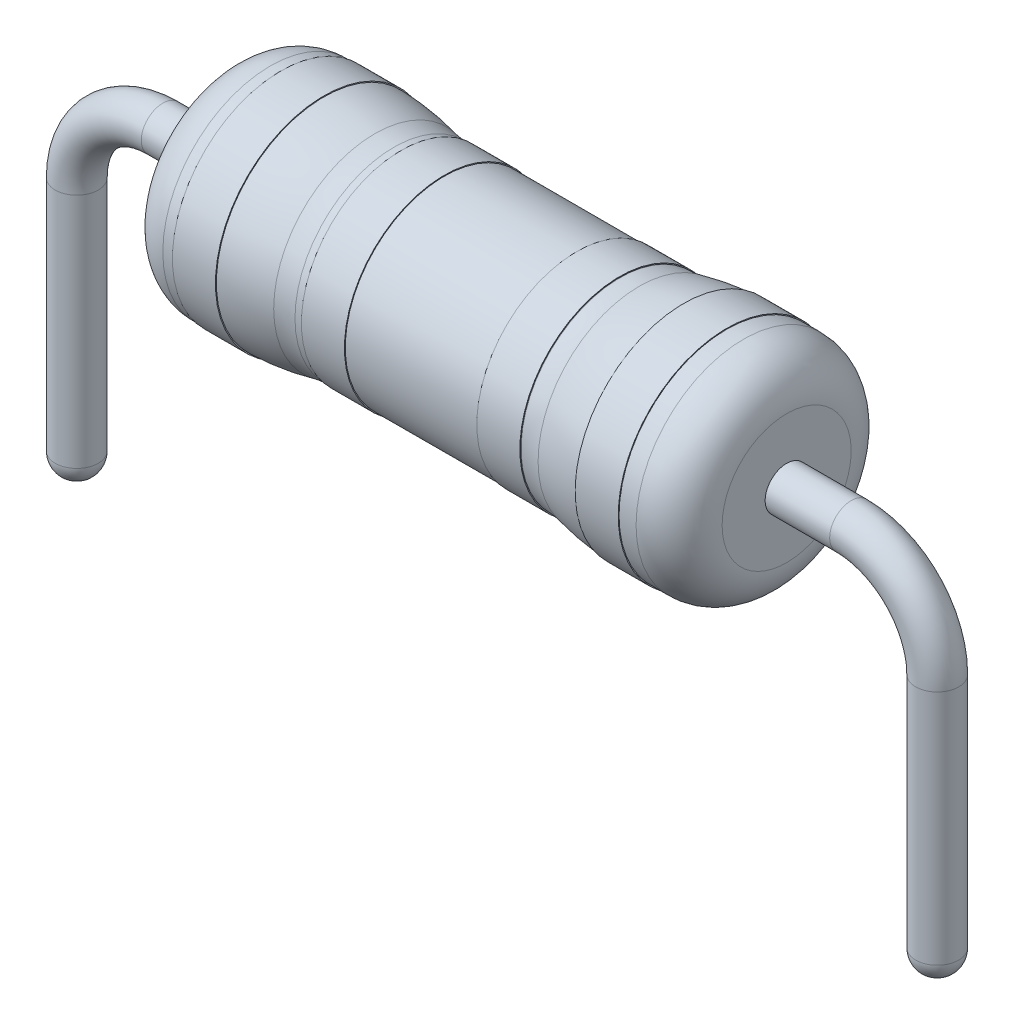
ISO-10303-21;
HEADER;
FILE_DESCRIPTION(('STEP AP214'),'2;1');
FILE_NAME('part.step','',(''),(''),'','','');
FILE_SCHEMA(('AUTOMOTIVE_DESIGN { 1 0 10303 214 1 1 1 1 }'));
ENDSEC;
DATA;
#1=APPLICATION_CONTEXT('core data for automotive mechanical design processes');
#2=APPLICATION_PROTOCOL_DEFINITION('international standard','automotive_design',2000,#1);
#3=PRODUCT_CONTEXT('',#1,'mechanical');
#4=PRODUCT('Part','Part','',(#3));
#5=PRODUCT_RELATED_PRODUCT_CATEGORY('part','',(#4));
#6=PRODUCT_DEFINITION_FORMATION('','',#4);
#7=PRODUCT_DEFINITION_CONTEXT('part definition',#1,'design');
#8=PRODUCT_DEFINITION('design','',#6,#7);
#9=PRODUCT_DEFINITION_SHAPE('','',#8);
#10=(LENGTH_UNIT() NAMED_UNIT(*) SI_UNIT(.MILLI.,.METRE.));
#11=(NAMED_UNIT(*) PLANE_ANGLE_UNIT() SI_UNIT($,.RADIAN.));
#12=(NAMED_UNIT(*) SI_UNIT($,.STERADIAN.) SOLID_ANGLE_UNIT());
#13=UNCERTAINTY_MEASURE_WITH_UNIT(LENGTH_MEASURE(1.E-05),#10,'distance_accuracy_value','');
#14=(GEOMETRIC_REPRESENTATION_CONTEXT(3) GLOBAL_UNCERTAINTY_ASSIGNED_CONTEXT((#13)) GLOBAL_UNIT_ASSIGNED_CONTEXT((#10,
#11,#12)) REPRESENTATION_CONTEXT('',''));
#15=CARTESIAN_POINT('',(0.,0.,0.));
#16=DIRECTION('',(0.,0.,1.));
#17=DIRECTION('',(1.,0.,0.));
#18=AXIS2_PLACEMENT_3D('',#15,#16,#17);
#19=CARTESIAN_POINT('',(3.25,-0.625,0.));
#20=DIRECTION('',(1.,0.,0.));
#21=DIRECTION('',(0.,0.,-1.));
#22=AXIS2_PLACEMENT_3D('',#19,#20,#21);
#23=CYLINDRICAL_SURFACE('',#22,1.15);
#24=CARTESIAN_POINT('',(0.808927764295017,-0.625,0.));
#25=DIRECTION('',(-1.,0.,0.));
#26=DIRECTION('',(0.,0.,1.));
#27=AXIS2_PLACEMENT_3D('',#24,#25,#26);
#28=CIRCLE('',#27,1.15);
#29=CARTESIAN_POINT('',(0.808927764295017,-0.625,1.15));
#30=VERTEX_POINT('',#29);
#31=EDGE_CURVE('E85',#30,#30,#28,.T.);
#32=ORIENTED_EDGE('',*,*,#31,.T.);
#33=EDGE_LOOP('',(#32));
#34=FACE_BOUND('',#33,.T.);
#35=CARTESIAN_POINT('',(-0.729654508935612,-0.625,0.));
#36=DIRECTION('',(1.,0.,0.));
#37=DIRECTION('',(0.,0.,-1.));
#38=AXIS2_PLACEMENT_3D('',#35,#36,#37);
#39=CIRCLE('',#38,1.15);
#40=CARTESIAN_POINT('',(-0.729654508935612,-0.625,-1.15));
#41=VERTEX_POINT('',#40);
#42=EDGE_CURVE('E100',#41,#41,#39,.T.);
#43=ORIENTED_EDGE('',*,*,#42,.T.);
#44=EDGE_LOOP('',(#43));
#45=FACE_BOUND('',#44,.T.);
#46=ADVANCED_FACE('F66',(#34,#45),#23,.T.);
#47=CARTESIAN_POINT('',(-1.22965450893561,-0.625,0.));
#48=DIRECTION('',(-1.,0.,0.));
#49=DIRECTION('',(0.,0.,1.));
#50=AXIS2_PLACEMENT_3D('',#47,#48,#49);
#51=CIRCLE('',#50,1.15);
#52=CARTESIAN_POINT('',(-1.22965450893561,-0.625,1.15));
#53=VERTEX_POINT('',#52);
#54=EDGE_CURVE('E95',#53,#53,#51,.T.);
#55=ORIENTED_EDGE('',*,*,#54,.T.);
#56=EDGE_LOOP('',(#55));
#57=FACE_BOUND('',#56,.T.);
#58=CARTESIAN_POINT('',(-1.31411010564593,-0.625,0.));
#59=DIRECTION('',(-1.,0.,0.));
#60=DIRECTION('',(0.,0.,1.));
#61=AXIS2_PLACEMENT_3D('',#58,#59,#60);
#62=CIRCLE('',#61,1.15);
#63=CARTESIAN_POINT('',(-1.31411010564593,-0.625,1.15));
#64=VERTEX_POINT('',#63);
#65=EDGE_CURVE('E138',#64,#64,#62,.F.);
#66=ORIENTED_EDGE('',*,*,#65,.T.);
#67=EDGE_LOOP('',(#66));
#68=FACE_BOUND('',#67,.T.);
#69=ADVANCED_FACE('F215',(#57,#68),#23,.T.);
#70=CARTESIAN_POINT('',(-1.31411010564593,-0.625,0.));
#71=DIRECTION('',(-1.,0.,0.));
#72=DIRECTION('',(0.,0.,1.));
#73=AXIS2_PLACEMENT_3D('',#70,#71,#72);
#74=TOROIDAL_SURFACE('',#73,2.15,1.);
#75=CARTESIAN_POINT('',(-1.53631496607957,-0.625,0.));
#76=DIRECTION('',(1.,0.,0.));
#77=DIRECTION('',(0.,0.,-1.));
#78=AXIS2_PLACEMENT_3D('',#75,#76,#77);
#79=CIRCLE('',#78,1.17500000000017);
#80=CARTESIAN_POINT('',(-1.53631496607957,-0.625,-1.17500000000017));
#81=VERTEX_POINT('',#80);
#82=EDGE_CURVE('E126',#81,#81,#79,.T.);
#83=ORIENTED_EDGE('',*,*,#82,.T.);
#84=EDGE_LOOP('',(#83));
#85=FACE_BOUND('',#84,.T.);
#86=ORIENTED_EDGE('',*,*,#65,.F.);
#87=EDGE_LOOP('',(#86));
#88=FACE_BOUND('',#87,.T.);
#89=ADVANCED_FACE('F221',(#85,#88),#74,.F.);
#90=CARTESIAN_POINT('',(-2.20292954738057,-0.625,0.));
#91=DIRECTION('',(-1.,0.,0.));
#92=DIRECTION('',(0.,0.,1.));
#93=AXIS2_PLACEMENT_3D('',#90,#91,#92);
#94=DEGENERATE_TOROIDAL_SURFACE('',#93,1.74999999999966,3.,.F.);
#95=CARTESIAN_POINT('',(-2.12840749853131,-0.625,0.));
#96=DIRECTION('',(1.,0.,0.));
#97=DIRECTION('',(0.,0.,-1.));
#98=AXIS2_PLACEMENT_3D('',#95,#96,#97);
#99=CIRCLE('',#98,1.24907426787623);
#100=CARTESIAN_POINT('',(-2.12840749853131,-0.625,-1.24907426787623));
#101=VERTEX_POINT('',#100);
#102=EDGE_CURVE('E75',#101,#101,#99,.F.);
#103=ORIENTED_EDGE('',*,*,#102,.F.);
#104=EDGE_LOOP('',(#103));
#105=FACE_BOUND('',#104,.T.);
#106=ORIENTED_EDGE('',*,*,#82,.F.);
#107=EDGE_LOOP('',(#106));
#108=FACE_BOUND('',#107,.T.);
#109=ADVANCED_FACE('F282',(#105,#108),#94,.F.);
#110=CARTESIAN_POINT('',(-2.62840749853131,-0.625,0.));
#111=DIRECTION('',(-1.,0.,0.));
#112=DIRECTION('',(0.,0.,1.));
#113=AXIS2_PLACEMENT_3D('',#110,#111,#112);
#114=PLANE('',#113);
#115=CARTESIAN_POINT('',(-2.62840749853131,-0.625,0.));
#116=DIRECTION('',(-1.,0.,0.));
#117=DIRECTION('',(0.,0.,1.));
#118=AXIS2_PLACEMENT_3D('',#115,#116,#117);
#119=CIRCLE('',#118,1.25);
#120=CARTESIAN_POINT('',(-2.62840749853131,-0.625,1.25));
#121=VERTEX_POINT('',#120);
#122=EDGE_CURVE('E105',#121,#121,#119,.T.);
#123=ORIENTED_EDGE('',*,*,#122,.F.);
#124=EDGE_LOOP('',(#123));
#125=FACE_BOUND('',#124,.T.);
#126=CARTESIAN_POINT('',(-2.62840749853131,-0.625,0.));
#127=DIRECTION('',(1.,0.,0.));
#128=DIRECTION('',(0.,0.,-1.));
#129=AXIS2_PLACEMENT_3D('',#126,#127,#128);
#130=CIRCLE('',#129,1.26);
#131=CARTESIAN_POINT('',(-2.62840749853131,-0.625,-1.26));
#132=VERTEX_POINT('',#131);
#133=EDGE_CURVE('E109',#132,#132,#130,.T.);
#134=ORIENTED_EDGE('',*,*,#133,.F.);
#135=EDGE_LOOP('',(#134));
#136=FACE_BOUND('',#135,.T.);
#137=ADVANCED_FACE('F278',(#125,#136),#114,.T.);
#138=CARTESIAN_POINT('',(3.25,-0.625,0.));
#139=DIRECTION('',(1.,0.,0.));
#140=DIRECTION('',(0.,0.,-1.));
#141=AXIS2_PLACEMENT_3D('',#138,#139,#140);
#142=CYLINDRICAL_SURFACE('',#141,1.26);
#143=ORIENTED_EDGE('',*,*,#133,.T.);
#144=EDGE_LOOP('',(#143));
#145=FACE_BOUND('',#144,.T.);
#146=CARTESIAN_POINT('',(-2.12840749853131,-0.625,0.));
#147=DIRECTION('',(1.,0.,0.));
#148=DIRECTION('',(0.,0.,-1.));
#149=AXIS2_PLACEMENT_3D('',#146,#147,#148);
#150=CIRCLE('',#149,1.26);
#151=CARTESIAN_POINT('',(-2.12840749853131,-0.625,-1.26));
#152=VERTEX_POINT('',#151);
#153=EDGE_CURVE('E99',#152,#152,#150,.T.);
#154=ORIENTED_EDGE('',*,*,#153,.F.);
#155=EDGE_LOOP('',(#154));
#156=FACE_BOUND('',#155,.T.);
#157=ADVANCED_FACE('F274',(#145,#156),#142,.T.);
#158=CARTESIAN_POINT('',(-2.12840749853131,-0.625,0.));
#159=DIRECTION('',(1.,0.,0.));
#160=DIRECTION('',(0.,0.,-1.));
#161=AXIS2_PLACEMENT_3D('',#158,#159,#160);
#162=PLANE('',#161);
#163=ORIENTED_EDGE('',*,*,#102,.T.);
#164=EDGE_LOOP('',(#163));
#165=FACE_BOUND('',#164,.T.);
#166=ORIENTED_EDGE('',*,*,#153,.T.);
#167=EDGE_LOOP('',(#166));
#168=FACE_BOUND('',#167,.T.);
#169=ADVANCED_FACE('F270',(#165,#168),#162,.T.);
#170=CARTESIAN_POINT('',(-5.,-4.375,0.));
#171=DIRECTION('',(0.,1.,0.));
#172=DIRECTION('',(0.,0.,1.));
#173=AXIS2_PLACEMENT_3D('',#170,#171,#172);
#174=SPHERICAL_SURFACE('',#173,0.25);
#175=CARTESIAN_POINT('',(-5.,-4.375,0.));
#176=DIRECTION('',(0.,-1.,0.));
#177=DIRECTION('',(1.,0.,0.));
#178=AXIS2_PLACEMENT_3D('',#175,#176,#177);
#179=CIRCLE('',#178,0.25);
#180=CARTESIAN_POINT('',(-4.75,-4.375,0.));
#181=VERTEX_POINT('',#180);
#182=EDGE_CURVE('E114',#181,#181,#179,.F.);
#183=ORIENTED_EDGE('',*,*,#182,.F.);
#184=EDGE_LOOP('',(#183));
#185=FACE_BOUND('',#184,.T.);
#186=ADVANCED_FACE('F273',(#185),#174,.T.);
#187=CARTESIAN_POINT('',(-5.,-1.62500000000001,0.));
#188=DIRECTION('',(0.,-1.,0.));
#189=DIRECTION('',(1.,0.,0.));
#190=AXIS2_PLACEMENT_3D('',#187,#188,#189);
#191=CYLINDRICAL_SURFACE('',#190,0.25);
#192=ORIENTED_EDGE('',*,*,#182,.T.);
#193=EDGE_LOOP('',(#192));
#194=FACE_BOUND('',#193,.T.);
#195=CARTESIAN_POINT('',(-5.00000000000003,-1.62499999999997,0.));
#196=DIRECTION('',(0.,1.,0.));
#197=DIRECTION('',(0.,0.,1.));
#198=AXIS2_PLACEMENT_3D('',#195,#196,#197);
#199=CIRCLE('',#198,0.25);
#200=CARTESIAN_POINT('',(-5.25,-1.62499999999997,0.));
#201=VERTEX_POINT('',#200);
#202=EDGE_CURVE('E158',#201,#201,#199,.T.);
#203=ORIENTED_EDGE('',*,*,#202,.F.);
#204=EDGE_LOOP('',(#203));
#205=FACE_BOUND('',#204,.T.);
#206=ADVANCED_FACE('F304',(#194,#205),#191,.T.);
#207=CARTESIAN_POINT('',(-4.,-1.625,0.));
#208=DIRECTION('',(0.,0.,1.));
#209=DIRECTION('',(1.,0.,0.));
#210=AXIS2_PLACEMENT_3D('',#207,#208,#209);
#211=TOROIDAL_SURFACE('',#210,1.,0.25);
#212=CARTESIAN_POINT('',(-3.99999999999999,-0.625,0.));
#213=DIRECTION('',(1.,0.,0.));
#214=DIRECTION('',(0.,0.,1.));
#215=AXIS2_PLACEMENT_3D('',#212,#213,#214);
#216=CIRCLE('',#215,0.25);
#217=CARTESIAN_POINT('',(-3.99999999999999,-0.374999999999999,0.));
#218=VERTEX_POINT('',#217);
#219=EDGE_CURVE('E162',#218,#218,#216,.T.);
#220=CARTESIAN_POINT('',(-4.,-1.625,0.));
#221=DIRECTION('',(0.,0.,1.));
#222=DIRECTION('',(1.,0.,0.));
#223=AXIS2_PLACEMENT_3D('',#220,#221,#222);
#224=CIRCLE('',#223,1.25);
#225=EDGE_CURVE('',#218,#201,#224,.T.);
#226=ORIENTED_EDGE('',*,*,#219,.F.);
#227=ORIENTED_EDGE('',*,*,#202,.T.);
#228=ORIENTED_EDGE('',*,*,#225,.T.);
#229=ORIENTED_EDGE('',*,*,#225,.F.);
#230=EDGE_LOOP('',(#226,#228,#227,#229));
#231=FACE_BOUND('',#230,.T.);
#232=ADVANCED_FACE('F301',(#231),#211,.T.);
#233=CARTESIAN_POINT('',(0.,-0.625,0.));
#234=DIRECTION('',(-1.,0.,0.));
#235=DIRECTION('',(0.,0.,1.));
#236=AXIS2_PLACEMENT_3D('',#233,#234,#235);
#237=CYLINDRICAL_SURFACE('',#236,0.25);
#238=ORIENTED_EDGE('',*,*,#219,.T.);
#239=EDGE_LOOP('',(#238));
#240=FACE_BOUND('',#239,.T.);
#241=CARTESIAN_POINT('',(-3.25,-0.625,0.));
#242=DIRECTION('',(1.,0.,0.));
#243=DIRECTION('',(0.,0.,-1.));
#244=AXIS2_PLACEMENT_3D('',#241,#242,#243);
#245=CIRCLE('',#244,0.25);
#246=CARTESIAN_POINT('',(-3.25,-0.625,-0.25));
#247=VERTEX_POINT('',#246);
#248=EDGE_CURVE('E122',#247,#247,#245,.F.);
#249=ORIENTED_EDGE('',*,*,#248,.T.);
#250=EDGE_LOOP('',(#249));
#251=FACE_BOUND('',#250,.T.);
#252=ADVANCED_FACE('F297',(#240,#251),#237,.T.);
#253=CARTESIAN_POINT('',(-3.25,-0.625,0.));
#254=DIRECTION('',(1.,0.,0.));
#255=DIRECTION('',(0.,0.,-1.));
#256=AXIS2_PLACEMENT_3D('',#253,#254,#255);
#257=PLANE('',#256);
#258=ORIENTED_EDGE('',*,*,#248,.F.);
#259=EDGE_LOOP('',(#258));
#260=FACE_BOUND('',#259,.T.);
#261=CARTESIAN_POINT('',(-3.25,-0.625,0.));
#262=DIRECTION('',(1.,0.,0.));
#263=DIRECTION('',(0.,0.,-1.));
#264=AXIS2_PLACEMENT_3D('',#261,#262,#263);
#265=CIRCLE('',#264,0.75);
#266=CARTESIAN_POINT('',(-3.25,-0.625,-0.75));
#267=VERTEX_POINT('',#266);
#268=EDGE_CURVE('E146',#267,#267,#265,.F.);
#269=ORIENTED_EDGE('',*,*,#268,.T.);
#270=EDGE_LOOP('',(#269));
#271=FACE_BOUND('',#270,.T.);
#272=ADVANCED_FACE('F300',(#260,#271),#257,.F.);
#273=CARTESIAN_POINT('',(-2.75,-0.625,0.));
#274=DIRECTION('',(1.,0.,0.));
#275=DIRECTION('',(0.,0.,-1.));
#276=AXIS2_PLACEMENT_3D('',#273,#274,#275);
#277=TOROIDAL_SURFACE('',#276,0.75,0.5);
#278=CARTESIAN_POINT('',(-2.75,-0.625,0.));
#279=DIRECTION('',(1.,0.,0.));
#280=DIRECTION('',(0.,0.,-1.));
#281=AXIS2_PLACEMENT_3D('',#278,#279,#280);
#282=CIRCLE('',#281,1.25);
#283=CARTESIAN_POINT('',(-2.75,-0.625,-1.25));
#284=VERTEX_POINT('',#283);
#285=EDGE_CURVE('E142',#284,#284,#282,.T.);
#286=ORIENTED_EDGE('',*,*,#285,.F.);
#287=EDGE_LOOP('',(#286));
#288=FACE_BOUND('',#287,.T.);
#289=ORIENTED_EDGE('',*,*,#268,.F.);
#290=EDGE_LOOP('',(#289));
#291=FACE_BOUND('',#290,.T.);
#292=ADVANCED_FACE('F322',(#288,#291),#277,.T.);
#293=CARTESIAN_POINT('',(-3.25,-0.625,0.));
#294=DIRECTION('',(-1.,0.,0.));
#295=DIRECTION('',(0.,0.,1.));
#296=AXIS2_PLACEMENT_3D('',#293,#294,#295);
#297=CYLINDRICAL_SURFACE('',#296,1.25);
#298=ORIENTED_EDGE('',*,*,#122,.T.);
#299=EDGE_LOOP('',(#298));
#300=FACE_BOUND('',#299,.T.);
#301=ORIENTED_EDGE('',*,*,#285,.T.);
#302=EDGE_LOOP('',(#301));
#303=FACE_BOUND('',#302,.T.);
#304=ADVANCED_FACE('F268',(#300,#303),#297,.T.);
#305=CARTESIAN_POINT('',(-1.22965450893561,-0.625,0.));
#306=DIRECTION('',(-1.,0.,0.));
#307=DIRECTION('',(0.,0.,1.));
#308=AXIS2_PLACEMENT_3D('',#305,#306,#307);
#309=PLANE('',#308);
#310=ORIENTED_EDGE('',*,*,#54,.F.);
#311=EDGE_LOOP('',(#310));
#312=FACE_BOUND('',#311,.T.);
#313=CARTESIAN_POINT('',(-1.22965450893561,-0.625,0.));
#314=DIRECTION('',(1.,0.,0.));
#315=DIRECTION('',(0.,0.,-1.));
#316=AXIS2_PLACEMENT_3D('',#313,#314,#315);
#317=CIRCLE('',#316,1.16);
#318=CARTESIAN_POINT('',(-1.22965450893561,-0.625,-1.16));
#319=VERTEX_POINT('',#318);
#320=EDGE_CURVE('E104',#319,#319,#317,.T.);
#321=ORIENTED_EDGE('',*,*,#320,.F.);
#322=EDGE_LOOP('',(#321));
#323=FACE_BOUND('',#322,.T.);
#324=ADVANCED_FACE('F264',(#312,#323),#309,.T.);
#325=CARTESIAN_POINT('',(3.25,-0.625,0.));
#326=DIRECTION('',(1.,0.,0.));
#327=DIRECTION('',(0.,0.,-1.));
#328=AXIS2_PLACEMENT_3D('',#325,#326,#327);
#329=CYLINDRICAL_SURFACE('',#328,1.16);
#330=ORIENTED_EDGE('',*,*,#320,.T.);
#331=EDGE_LOOP('',(#330));
#332=FACE_BOUND('',#331,.T.);
#333=CARTESIAN_POINT('',(-0.729654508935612,-0.625,0.));
#334=DIRECTION('',(1.,0.,0.));
#335=DIRECTION('',(0.,0.,-1.));
#336=AXIS2_PLACEMENT_3D('',#333,#334,#335);
#337=CIRCLE('',#336,1.16);
#338=CARTESIAN_POINT('',(-0.729654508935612,-0.625,-1.16));
#339=VERTEX_POINT('',#338);
#340=EDGE_CURVE('E89',#339,#339,#337,.T.);
#341=ORIENTED_EDGE('',*,*,#340,.F.);
#342=EDGE_LOOP('',(#341));
#343=FACE_BOUND('',#342,.T.);
#344=ADVANCED_FACE('F260',(#332,#343),#329,.T.);
#345=CARTESIAN_POINT('',(-0.729654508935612,-0.625,0.));
#346=DIRECTION('',(1.,0.,0.));
#347=DIRECTION('',(0.,0.,-1.));
#348=AXIS2_PLACEMENT_3D('',#345,#346,#347);
#349=PLANE('',#348);
#350=ORIENTED_EDGE('',*,*,#42,.F.);
#351=EDGE_LOOP('',(#350));
#352=FACE_BOUND('',#351,.T.);
#353=ORIENTED_EDGE('',*,*,#340,.T.);
#354=EDGE_LOOP('',(#353));
#355=FACE_BOUND('',#354,.T.);
#356=ADVANCED_FACE('F254',(#352,#355),#349,.T.);
#357=CARTESIAN_POINT('',(0.808927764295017,-0.625,0.));
#358=DIRECTION('',(-1.,0.,0.));
#359=DIRECTION('',(0.,0.,1.));
#360=AXIS2_PLACEMENT_3D('',#357,#358,#359);
#361=PLANE('',#360);
#362=ORIENTED_EDGE('',*,*,#31,.F.);
#363=EDGE_LOOP('',(#362));
#364=FACE_BOUND('',#363,.T.);
#365=CARTESIAN_POINT('',(0.808927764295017,-0.625,0.));
#366=DIRECTION('',(1.,0.,0.));
#367=DIRECTION('',(0.,0.,-1.));
#368=AXIS2_PLACEMENT_3D('',#365,#366,#367);
#369=CIRCLE('',#368,1.16);
#370=CARTESIAN_POINT('',(0.808927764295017,-0.625,-1.16));
#371=VERTEX_POINT('',#370);
#372=EDGE_CURVE('E94',#371,#371,#369,.T.);
#373=ORIENTED_EDGE('',*,*,#372,.F.);
#374=EDGE_LOOP('',(#373));
#375=FACE_BOUND('',#374,.T.);
#376=ADVANCED_FACE('F248',(#364,#375),#361,.T.);
#377=CARTESIAN_POINT('',(3.25,-0.625,0.));
#378=DIRECTION('',(1.,0.,0.));
#379=DIRECTION('',(0.,0.,-1.));
#380=AXIS2_PLACEMENT_3D('',#377,#378,#379);
#381=CYLINDRICAL_SURFACE('',#380,1.16);
#382=ORIENTED_EDGE('',*,*,#372,.T.);
#383=EDGE_LOOP('',(#382));
#384=FACE_BOUND('',#383,.T.);
#385=CARTESIAN_POINT('',(1.30892776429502,-0.625,0.));
#386=DIRECTION('',(1.,0.,0.));
#387=DIRECTION('',(0.,0.,-1.));
#388=AXIS2_PLACEMENT_3D('',#385,#386,#387);
#389=CIRCLE('',#388,1.16);
#390=CARTESIAN_POINT('',(1.30892776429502,-0.625,-1.16));
#391=VERTEX_POINT('',#390);
#392=EDGE_CURVE('E187',#391,#391,#389,.T.);
#393=ORIENTED_EDGE('',*,*,#392,.F.);
#394=EDGE_LOOP('',(#393));
#395=FACE_BOUND('',#394,.T.);
#396=ADVANCED_FACE('F243',(#384,#395),#381,.T.);
#397=CARTESIAN_POINT('',(1.30892776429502,-0.625,0.));
#398=DIRECTION('',(1.,0.,0.));
#399=DIRECTION('',(0.,0.,-1.));
#400=AXIS2_PLACEMENT_3D('',#397,#398,#399);
#401=PLANE('',#400);
#402=CARTESIAN_POINT('',(1.30892776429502,-0.625,0.));
#403=DIRECTION('',(1.,0.,0.));
#404=DIRECTION('',(0.,0.,-1.));
#405=AXIS2_PLACEMENT_3D('',#402,#403,#404);
#406=CIRCLE('',#405,1.15);
#407=CARTESIAN_POINT('',(1.30892776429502,-0.625,-1.15));
#408=VERTEX_POINT('',#407);
#409=EDGE_CURVE('E90',#408,#408,#406,.T.);
#410=ORIENTED_EDGE('',*,*,#409,.F.);
#411=EDGE_LOOP('',(#410));
#412=FACE_BOUND('',#411,.T.);
#413=ORIENTED_EDGE('',*,*,#392,.T.);
#414=EDGE_LOOP('',(#413));
#415=FACE_BOUND('',#414,.T.);
#416=ADVANCED_FACE('F240',(#412,#415),#401,.T.);
#417=CARTESIAN_POINT('',(2.20292954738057,-0.625,0.));
#418=DIRECTION('',(-1.,0.,0.));
#419=DIRECTION('',(0.,0.,1.));
#420=AXIS2_PLACEMENT_3D('',#417,#418,#419);
#421=DEGENERATE_TOROIDAL_SURFACE('',#420,1.74999999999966,3.,.F.);
#422=CARTESIAN_POINT('',(2.05206951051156,-0.625,0.));
#423=DIRECTION('',(-1.,0.,0.));
#424=DIRECTION('',(0.,0.,1.));
#425=AXIS2_PLACEMENT_3D('',#422,#423,#424);
#426=CIRCLE('',#425,1.24620447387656);
#427=CARTESIAN_POINT('',(2.05206951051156,-0.625,1.24620447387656));
#428=VERTEX_POINT('',#427);
#429=EDGE_CURVE('E11',#428,#428,#426,.F.);
#430=ORIENTED_EDGE('',*,*,#429,.F.);
#431=EDGE_LOOP('',(#430));
#432=FACE_BOUND('',#431,.T.);
#433=CARTESIAN_POINT('',(1.53631496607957,-0.625,0.));
#434=DIRECTION('',(-1.,0.,0.));
#435=DIRECTION('',(0.,0.,1.));
#436=AXIS2_PLACEMENT_3D('',#433,#434,#435);
#437=CIRCLE('',#436,1.17500000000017);
#438=CARTESIAN_POINT('',(1.53631496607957,-0.625,1.17500000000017));
#439=VERTEX_POINT('',#438);
#440=EDGE_CURVE('E130',#439,#439,#437,.T.);
#441=ORIENTED_EDGE('',*,*,#440,.F.);
#442=EDGE_LOOP('',(#441));
#443=FACE_BOUND('',#442,.T.);
#444=ADVANCED_FACE('F232',(#432,#443),#421,.F.);
#445=CARTESIAN_POINT('',(1.31411010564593,-0.625,0.));
#446=DIRECTION('',(1.,0.,0.));
#447=DIRECTION('',(0.,0.,-1.));
#448=AXIS2_PLACEMENT_3D('',#445,#446,#447);
#449=TOROIDAL_SURFACE('',#448,2.15,1.);
#450=ORIENTED_EDGE('',*,*,#440,.T.);
#451=EDGE_LOOP('',(#450));
#452=FACE_BOUND('',#451,.T.);
#453=CARTESIAN_POINT('',(1.31411010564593,-0.625,0.));
#454=DIRECTION('',(1.,0.,0.));
#455=DIRECTION('',(0.,0.,-1.));
#456=AXIS2_PLACEMENT_3D('',#453,#454,#455);
#457=CIRCLE('',#456,1.15);
#458=CARTESIAN_POINT('',(1.31411010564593,-0.625,-1.15));
#459=VERTEX_POINT('',#458);
#460=EDGE_CURVE('E134',#459,#459,#457,.F.);
#461=ORIENTED_EDGE('',*,*,#460,.F.);
#462=EDGE_LOOP('',(#461));
#463=FACE_BOUND('',#462,.T.);
#464=ADVANCED_FACE('F227',(#452,#463),#449,.F.);
#465=ORIENTED_EDGE('',*,*,#409,.T.);
#466=EDGE_LOOP('',(#465));
#467=FACE_BOUND('',#466,.T.);
#468=ORIENTED_EDGE('',*,*,#460,.T.);
#469=EDGE_LOOP('',(#468));
#470=FACE_BOUND('',#469,.T.);
#471=ADVANCED_FACE('F212',(#467,#470),#23,.T.);
#472=CARTESIAN_POINT('',(2.05206951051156,-0.625,0.));
#473=DIRECTION('',(-1.,0.,0.));
#474=DIRECTION('',(0.,0.,1.));
#475=AXIS2_PLACEMENT_3D('',#472,#473,#474);
#476=PLANE('',#475);
#477=ORIENTED_EDGE('',*,*,#429,.T.);
#478=EDGE_LOOP('',(#477));
#479=FACE_BOUND('',#478,.T.);
#480=CARTESIAN_POINT('',(2.05206951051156,-0.625,0.));
#481=DIRECTION('',(1.,0.,0.));
#482=DIRECTION('',(0.,0.,-1.));
#483=AXIS2_PLACEMENT_3D('',#480,#481,#482);
#484=CIRCLE('',#483,1.26);
#485=CARTESIAN_POINT('',(2.05206951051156,-0.625,-1.26));
#486=VERTEX_POINT('',#485);
#487=EDGE_CURVE('E191',#486,#486,#484,.T.);
#488=ORIENTED_EDGE('',*,*,#487,.F.);
#489=EDGE_LOOP('',(#488));
#490=FACE_BOUND('',#489,.T.);
#491=ADVANCED_FACE('F203',(#479,#490),#476,.T.);
#492=CARTESIAN_POINT('',(3.25,-0.625,0.));
#493=DIRECTION('',(1.,0.,0.));
#494=DIRECTION('',(0.,0.,-1.));
#495=AXIS2_PLACEMENT_3D('',#492,#493,#494);
#496=CYLINDRICAL_SURFACE('',#495,1.26);
#497=ORIENTED_EDGE('',*,*,#487,.T.);
#498=EDGE_LOOP('',(#497));
#499=FACE_BOUND('',#498,.T.);
#500=CARTESIAN_POINT('',(2.55206951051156,-0.625,0.));
#501=DIRECTION('',(1.,0.,0.));
#502=DIRECTION('',(0.,0.,-1.));
#503=AXIS2_PLACEMENT_3D('',#500,#501,#502);
#504=CIRCLE('',#503,1.26);
#505=CARTESIAN_POINT('',(2.55206951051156,-0.625,-1.26));
#506=VERTEX_POINT('',#505);
#507=EDGE_CURVE('E195',#506,#506,#504,.T.);
#508=ORIENTED_EDGE('',*,*,#507,.F.);
#509=EDGE_LOOP('',(#508));
#510=FACE_BOUND('',#509,.T.);
#511=ADVANCED_FACE('F201',(#499,#510),#496,.T.);
#512=CARTESIAN_POINT('',(2.55206951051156,-0.625,0.));
#513=DIRECTION('',(1.,0.,0.));
#514=DIRECTION('',(0.,0.,-1.));
#515=AXIS2_PLACEMENT_3D('',#512,#513,#514);
#516=PLANE('',#515);
#517=CARTESIAN_POINT('',(2.55206951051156,-0.625,0.));
#518=DIRECTION('',(1.,0.,0.));
#519=DIRECTION('',(0.,0.,-1.));
#520=AXIS2_PLACEMENT_3D('',#517,#518,#519);
#521=CIRCLE('',#520,1.25);
#522=CARTESIAN_POINT('',(2.55206951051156,-0.625,-1.25));
#523=VERTEX_POINT('',#522);
#524=EDGE_CURVE('E70',#523,#523,#521,.T.);
#525=ORIENTED_EDGE('',*,*,#524,.F.);
#526=EDGE_LOOP('',(#525));
#527=FACE_BOUND('',#526,.T.);
#528=ORIENTED_EDGE('',*,*,#507,.T.);
#529=EDGE_LOOP('',(#528));
#530=FACE_BOUND('',#529,.T.);
#531=ADVANCED_FACE('F199',(#527,#530),#516,.T.);
#532=CARTESIAN_POINT('',(5.,-4.375,0.));
#533=DIRECTION('',(0.,1.,0.));
#534=DIRECTION('',(0.,0.,1.));
#535=AXIS2_PLACEMENT_3D('',#532,#533,#534);
#536=SPHERICAL_SURFACE('',#535,0.25);
#537=CARTESIAN_POINT('',(5.,-4.375,0.));
#538=DIRECTION('',(0.,-1.,0.));
#539=DIRECTION('',(1.,0.,0.));
#540=AXIS2_PLACEMENT_3D('',#537,#538,#539);
#541=CIRCLE('',#540,0.25);
#542=CARTESIAN_POINT('',(5.25,-4.375,0.));
#543=VERTEX_POINT('',#542);
#544=EDGE_CURVE('E82',#543,#543,#541,.F.);
#545=ORIENTED_EDGE('',*,*,#544,.F.);
#546=EDGE_LOOP('',(#545));
#547=FACE_BOUND('',#546,.T.);
#548=ADVANCED_FACE('F68',(#547),#536,.T.);
#549=CARTESIAN_POINT('',(5.,-1.62500000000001,0.));
#550=DIRECTION('',(0.,-1.,0.));
#551=DIRECTION('',(1.,0.,0.));
#552=AXIS2_PLACEMENT_3D('',#549,#550,#551);
#553=CYLINDRICAL_SURFACE('',#552,0.25);
#554=ORIENTED_EDGE('',*,*,#544,.T.);
#555=EDGE_LOOP('',(#554));
#556=FACE_BOUND('',#555,.T.);
#557=CARTESIAN_POINT('',(5.00000000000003,-1.62499999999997,0.));
#558=DIRECTION('',(0.,-1.,0.));
#559=DIRECTION('',(0.,0.,1.));
#560=AXIS2_PLACEMENT_3D('',#557,#558,#559);
#561=CIRCLE('',#560,0.25);
#562=CARTESIAN_POINT('',(5.25,-1.62499999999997,0.));
#563=VERTEX_POINT('',#562);
#564=EDGE_CURVE('E166',#563,#563,#561,.F.);
#565=ORIENTED_EDGE('',*,*,#564,.F.);
#566=EDGE_LOOP('',(#565));
#567=FACE_BOUND('',#566,.T.);
#568=ADVANCED_FACE('F292',(#556,#567),#553,.T.);
#569=CARTESIAN_POINT('',(4.,-1.625,0.));
#570=DIRECTION('',(0.,0.,-1.));
#571=DIRECTION('',(-1.,0.,0.));
#572=AXIS2_PLACEMENT_3D('',#569,#570,#571);
#573=TOROIDAL_SURFACE('',#572,1.,0.25);
#574=CARTESIAN_POINT('',(3.99999999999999,-0.625,0.));
#575=DIRECTION('',(1.,0.,0.));
#576=DIRECTION('',(0.,0.,1.));
#577=AXIS2_PLACEMENT_3D('',#574,#575,#576);
#578=CIRCLE('',#577,0.25);
#579=CARTESIAN_POINT('',(3.99999999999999,-0.374999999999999,0.));
#580=VERTEX_POINT('',#579);
#581=EDGE_CURVE('E108',#580,#580,#578,.F.);
#582=CARTESIAN_POINT('',(4.,-1.625,0.));
#583=DIRECTION('',(0.,0.,-1.));
#584=DIRECTION('',(-1.,0.,0.));
#585=AXIS2_PLACEMENT_3D('',#582,#583,#584);
#586=CIRCLE('',#585,1.25);
#587=EDGE_CURVE('',#580,#563,#586,.T.);
#588=ORIENTED_EDGE('',*,*,#581,.F.);
#589=ORIENTED_EDGE('',*,*,#564,.T.);
#590=ORIENTED_EDGE('',*,*,#587,.T.);
#591=ORIENTED_EDGE('',*,*,#587,.F.);
#592=EDGE_LOOP('',(#588,#590,#589,#591));
#593=FACE_BOUND('',#592,.T.);
#594=ADVANCED_FACE('F288',(#593),#573,.T.);
#595=CARTESIAN_POINT('',(0.,-0.625,0.));
#596=DIRECTION('',(1.,0.,0.));
#597=DIRECTION('',(0.,0.,-1.));
#598=AXIS2_PLACEMENT_3D('',#595,#596,#597);
#599=CYLINDRICAL_SURFACE('',#598,0.25);
#600=ORIENTED_EDGE('',*,*,#581,.T.);
#601=EDGE_LOOP('',(#600));
#602=FACE_BOUND('',#601,.T.);
#603=CARTESIAN_POINT('',(3.25,-0.625,0.));
#604=DIRECTION('',(-1.,0.,0.));
#605=DIRECTION('',(0.,0.,1.));
#606=AXIS2_PLACEMENT_3D('',#603,#604,#605);
#607=CIRCLE('',#606,0.25);
#608=CARTESIAN_POINT('',(3.25,-0.625,0.25));
#609=VERTEX_POINT('',#608);
#610=EDGE_CURVE('E118',#609,#609,#607,.F.);
#611=ORIENTED_EDGE('',*,*,#610,.T.);
#612=EDGE_LOOP('',(#611));
#613=FACE_BOUND('',#612,.T.);
#614=ADVANCED_FACE('F284',(#602,#613),#599,.T.);
#615=CARTESIAN_POINT('',(3.25,-0.625,0.));
#616=DIRECTION('',(-1.,0.,0.));
#617=DIRECTION('',(0.,0.,1.));
#618=AXIS2_PLACEMENT_3D('',#615,#616,#617);
#619=PLANE('',#618);
#620=ORIENTED_EDGE('',*,*,#610,.F.);
#621=EDGE_LOOP('',(#620));
#622=FACE_BOUND('',#621,.T.);
#623=CARTESIAN_POINT('',(3.25,-0.625,0.));
#624=DIRECTION('',(-1.,0.,0.));
#625=DIRECTION('',(0.,0.,1.));
#626=AXIS2_PLACEMENT_3D('',#623,#624,#625);
#627=CIRCLE('',#626,0.75);
#628=CARTESIAN_POINT('',(3.25,-0.625,0.75));
#629=VERTEX_POINT('',#628);
#630=EDGE_CURVE('E150',#629,#629,#627,.F.);
#631=ORIENTED_EDGE('',*,*,#630,.T.);
#632=EDGE_LOOP('',(#631));
#633=FACE_BOUND('',#632,.T.);
#634=ADVANCED_FACE('F287',(#622,#633),#619,.F.);
#635=CARTESIAN_POINT('',(2.75,-0.625,0.));
#636=DIRECTION('',(-1.,0.,0.));
#637=DIRECTION('',(0.,0.,1.));
#638=AXIS2_PLACEMENT_3D('',#635,#636,#637);
#639=TOROIDAL_SURFACE('',#638,0.75,0.5);
#640=ORIENTED_EDGE('',*,*,#630,.F.);
#641=EDGE_LOOP('',(#640));
#642=FACE_BOUND('',#641,.T.);
#643=CARTESIAN_POINT('',(2.75,-0.625,0.));
#644=DIRECTION('',(-1.,0.,0.));
#645=DIRECTION('',(0.,0.,1.));
#646=AXIS2_PLACEMENT_3D('',#643,#644,#645);
#647=CIRCLE('',#646,1.25);
#648=CARTESIAN_POINT('',(2.75,-0.625,1.25));
#649=VERTEX_POINT('',#648);
#650=EDGE_CURVE('E154',#649,#649,#647,.T.);
#651=ORIENTED_EDGE('',*,*,#650,.F.);
#652=EDGE_LOOP('',(#651));
#653=FACE_BOUND('',#652,.T.);
#654=ADVANCED_FACE('F336',(#642,#653),#639,.T.);
#655=ORIENTED_EDGE('',*,*,#524,.T.);
#656=EDGE_LOOP('',(#655));
#657=FACE_BOUND('',#656,.T.);
#658=ORIENTED_EDGE('',*,*,#650,.T.);
#659=EDGE_LOOP('',(#658));
#660=FACE_BOUND('',#659,.T.);
#661=ADVANCED_FACE('F333',(#657,#660),#297,.T.);
#662=CLOSED_SHELL('',(#46,#69,#89,#109,#137,#157,#169,#186,#206,#232,#252,#272,#292,#304,#324,
#344,#356,#376,#396,#416,#444,#464,#471,#491,#511,#531,#548,#568,#594,#614,#634,#654,#661));
#663=MANIFOLD_SOLID_BREP('B2',#662);
#664=ADVANCED_BREP_SHAPE_REPRESENTATION('',(#18,#663),#14);
#665=SHAPE_DEFINITION_REPRESENTATION(#9,#664);
ENDSEC;
END-ISO-10303-21;
